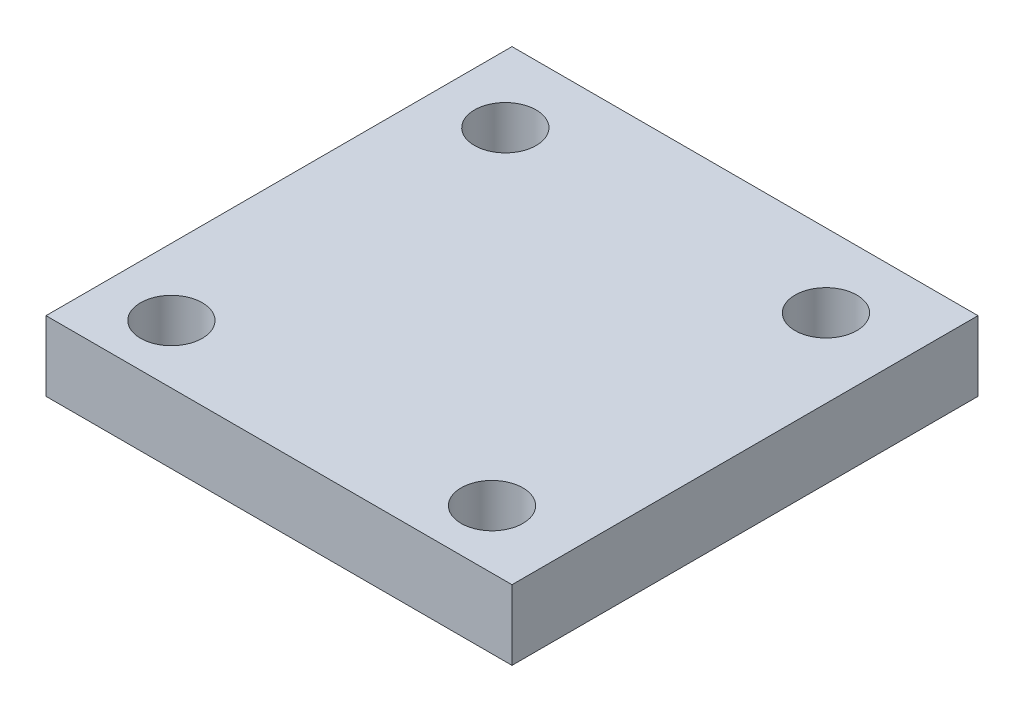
ISO-10303-21;
HEADER;
FILE_DESCRIPTION(('STEP AP214'),'2;1');
FILE_NAME('part.step','',(''),(''),'','','');
FILE_SCHEMA(('AUTOMOTIVE_DESIGN { 1 0 10303 214 1 1 1 1 }'));
ENDSEC;
DATA;
#1=APPLICATION_CONTEXT('core data for automotive mechanical design processes');
#2=APPLICATION_PROTOCOL_DEFINITION('international standard','automotive_design',2000,#1);
#3=PRODUCT_CONTEXT('',#1,'mechanical');
#4=PRODUCT('Part','Part','',(#3));
#5=PRODUCT_RELATED_PRODUCT_CATEGORY('part','',(#4));
#6=PRODUCT_DEFINITION_FORMATION('','',#4);
#7=PRODUCT_DEFINITION_CONTEXT('part definition',#1,'design');
#8=PRODUCT_DEFINITION('design','',#6,#7);
#9=PRODUCT_DEFINITION_SHAPE('','',#8);
#10=(LENGTH_UNIT() NAMED_UNIT(*) SI_UNIT(.MILLI.,.METRE.));
#11=(NAMED_UNIT(*) PLANE_ANGLE_UNIT() SI_UNIT($,.RADIAN.));
#12=(NAMED_UNIT(*) SI_UNIT($,.STERADIAN.) SOLID_ANGLE_UNIT());
#13=UNCERTAINTY_MEASURE_WITH_UNIT(LENGTH_MEASURE(1.E-05),#10,'distance_accuracy_value','');
#14=(GEOMETRIC_REPRESENTATION_CONTEXT(3) GLOBAL_UNCERTAINTY_ASSIGNED_CONTEXT((#13)) GLOBAL_UNIT_ASSIGNED_CONTEXT((#10,
#11,#12)) REPRESENTATION_CONTEXT('',''));
#15=CARTESIAN_POINT('',(0.,0.,0.));
#16=DIRECTION('',(0.,0.,1.));
#17=DIRECTION('',(1.,0.,0.));
#18=AXIS2_PLACEMENT_3D('',#15,#16,#17);
#19=CARTESIAN_POINT('',(-100.,30.,-100.));
#20=DIRECTION('',(1.,0.,0.));
#21=DIRECTION('',(0.,0.,-1.));
#22=AXIS2_PLACEMENT_3D('',#19,#20,#21);
#23=PLANE('',#22);
#24=DIRECTION('',(0.,0.,1.));
#25=VECTOR('',#24,1.);
#26=CARTESIAN_POINT('',(-100.,0.,-100.));
#27=LINE('',#26,#25);
#28=CARTESIAN_POINT('',(-100.,0.,-100.));
#29=VERTEX_POINT('',#28);
#30=CARTESIAN_POINT('',(-100.,0.,100.));
#31=VERTEX_POINT('',#30);
#32=EDGE_CURVE('E80',#29,#31,#27,.T.);
#33=ORIENTED_EDGE('',*,*,#32,.T.);
#34=DIRECTION('',(0.,-1.,0.));
#35=VECTOR('',#34,1.);
#36=CARTESIAN_POINT('',(-100.,30.,100.));
#37=LINE('',#36,#35);
#38=CARTESIAN_POINT('',(-100.,30.,100.));
#39=VERTEX_POINT('',#38);
#40=EDGE_CURVE('E11',#39,#31,#37,.T.);
#41=ORIENTED_EDGE('',*,*,#40,.F.);
#42=DIRECTION('',(0.,0.,1.));
#43=VECTOR('',#42,1.);
#44=CARTESIAN_POINT('',(-100.,30.,-100.));
#45=LINE('',#44,#43);
#46=CARTESIAN_POINT('',(-100.,30.,-100.));
#47=VERTEX_POINT('',#46);
#48=EDGE_CURVE('E103',#47,#39,#45,.T.);
#49=ORIENTED_EDGE('',*,*,#48,.F.);
#50=DIRECTION('',(0.,-1.,0.));
#51=VECTOR('',#50,1.);
#52=CARTESIAN_POINT('',(-100.,30.,-100.));
#53=LINE('',#52,#51);
#54=EDGE_CURVE('E92',#47,#29,#53,.T.);
#55=ORIENTED_EDGE('',*,*,#54,.T.);
#56=EDGE_LOOP('',(#33,#41,#49,#55));
#57=FACE_BOUND('',#56,.T.);
#58=ADVANCED_FACE('F36',(#57),#23,.F.);
#59=CARTESIAN_POINT('',(-100.,30.,100.));
#60=DIRECTION('',(0.,0.,-1.));
#61=DIRECTION('',(-1.,0.,0.));
#62=AXIS2_PLACEMENT_3D('',#59,#60,#61);
#63=PLANE('',#62);
#64=DIRECTION('',(1.,0.,0.));
#65=VECTOR('',#64,1.);
#66=CARTESIAN_POINT('',(-100.,0.,100.));
#67=LINE('',#66,#65);
#68=CARTESIAN_POINT('',(100.,0.,100.));
#69=VERTEX_POINT('',#68);
#70=EDGE_CURVE('E76',#31,#69,#67,.T.);
#71=ORIENTED_EDGE('',*,*,#70,.T.);
#72=DIRECTION('',(0.,-1.,0.));
#73=VECTOR('',#72,1.);
#74=CARTESIAN_POINT('',(100.,30.,100.));
#75=LINE('',#74,#73);
#76=CARTESIAN_POINT('',(100.,30.,100.));
#77=VERTEX_POINT('',#76);
#78=EDGE_CURVE('E43',#77,#69,#75,.T.);
#79=ORIENTED_EDGE('',*,*,#78,.F.);
#80=DIRECTION('',(1.,0.,0.));
#81=VECTOR('',#80,1.);
#82=CARTESIAN_POINT('',(-100.,30.,100.));
#83=LINE('',#82,#81);
#84=EDGE_CURVE('E88',#39,#77,#83,.T.);
#85=ORIENTED_EDGE('',*,*,#84,.F.);
#86=ORIENTED_EDGE('',*,*,#40,.T.);
#87=EDGE_LOOP('',(#71,#79,#85,#86));
#88=FACE_BOUND('',#87,.T.);
#89=ADVANCED_FACE('F87',(#88),#63,.F.);
#90=CARTESIAN_POINT('',(100.,30.,-100.));
#91=DIRECTION('',(-1.,0.,0.));
#92=DIRECTION('',(0.,0.,1.));
#93=AXIS2_PLACEMENT_3D('',#90,#91,#92);
#94=PLANE('',#93);
#95=DIRECTION('',(0.,0.,-1.));
#96=VECTOR('',#95,1.);
#97=CARTESIAN_POINT('',(100.,0.,-100.));
#98=LINE('',#97,#96);
#99=CARTESIAN_POINT('',(100.,0.,-100.));
#100=VERTEX_POINT('',#99);
#101=EDGE_CURVE('E81',#69,#100,#98,.T.);
#102=ORIENTED_EDGE('',*,*,#101,.T.);
#103=DIRECTION('',(0.,-1.,0.));
#104=VECTOR('',#103,1.);
#105=CARTESIAN_POINT('',(100.,30.,-100.));
#106=LINE('',#105,#104);
#107=CARTESIAN_POINT('',(100.,30.,-100.));
#108=VERTEX_POINT('',#107);
#109=EDGE_CURVE('E109',#108,#100,#106,.T.);
#110=ORIENTED_EDGE('',*,*,#109,.F.);
#111=DIRECTION('',(0.,0.,-1.));
#112=VECTOR('',#111,1.);
#113=CARTESIAN_POINT('',(100.,30.,-100.));
#114=LINE('',#113,#112);
#115=EDGE_CURVE('E55',#77,#108,#114,.T.);
#116=ORIENTED_EDGE('',*,*,#115,.F.);
#117=ORIENTED_EDGE('',*,*,#78,.T.);
#118=EDGE_LOOP('',(#102,#110,#116,#117));
#119=FACE_BOUND('',#118,.T.);
#120=ADVANCED_FACE('F112',(#119),#94,.F.);
#121=CARTESIAN_POINT('',(-100.,30.,-100.));
#122=DIRECTION('',(0.,0.,1.));
#123=DIRECTION('',(1.,0.,0.));
#124=AXIS2_PLACEMENT_3D('',#121,#122,#123);
#125=PLANE('',#124);
#126=DIRECTION('',(-1.,0.,0.));
#127=VECTOR('',#126,1.);
#128=CARTESIAN_POINT('',(-100.,0.,-100.));
#129=LINE('',#128,#127);
#130=EDGE_CURVE('E101',#100,#29,#129,.T.);
#131=ORIENTED_EDGE('',*,*,#130,.T.);
#132=ORIENTED_EDGE('',*,*,#54,.F.);
#133=DIRECTION('',(-1.,0.,0.));
#134=VECTOR('',#133,1.);
#135=CARTESIAN_POINT('',(-100.,30.,-100.));
#136=LINE('',#135,#134);
#137=EDGE_CURVE('E50',#108,#47,#136,.T.);
#138=ORIENTED_EDGE('',*,*,#137,.F.);
#139=ORIENTED_EDGE('',*,*,#109,.T.);
#140=EDGE_LOOP('',(#131,#132,#138,#139));
#141=FACE_BOUND('',#140,.T.);
#142=ADVANCED_FACE('F114',(#141),#125,.F.);
#143=CARTESIAN_POINT('',(-100.,30.,100.));
#144=DIRECTION('',(0.,1.,0.));
#145=DIRECTION('',(0.,0.,1.));
#146=AXIS2_PLACEMENT_3D('',#143,#144,#145);
#147=PLANE('',#146);
#148=CARTESIAN_POINT('',(-71.2788259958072,30.,74.899942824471));
#149=DIRECTION('',(0.,1.,0.));
#150=DIRECTION('',(0.,0.,1.));
#151=AXIS2_PLACEMENT_3D('',#148,#149,#150);
#152=CIRCLE('',#151,13.25);
#153=CARTESIAN_POINT('',(-71.2788259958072,30.,88.149942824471));
#154=VERTEX_POINT('',#153);
#155=EDGE_CURVE('E209',#154,#154,#152,.T.);
#156=ORIENTED_EDGE('',*,*,#155,.F.);
#157=EDGE_LOOP('',(#156));
#158=FACE_BOUND('',#157,.T.);
#159=CARTESIAN_POINT('',(66.3236134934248,30.,74.899942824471));
#160=DIRECTION('',(0.,1.,0.));
#161=DIRECTION('',(0.,0.,1.));
#162=AXIS2_PLACEMENT_3D('',#159,#160,#161);
#163=CIRCLE('',#162,13.25);
#164=CARTESIAN_POINT('',(66.3236134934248,30.,88.149942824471));
#165=VERTEX_POINT('',#164);
#166=EDGE_CURVE('E213',#165,#165,#163,.T.);
#167=ORIENTED_EDGE('',*,*,#166,.F.);
#168=EDGE_LOOP('',(#167));
#169=FACE_BOUND('',#168,.T.);
#170=CARTESIAN_POINT('',(66.3236134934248,30.,-68.4200495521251));
#171=DIRECTION('',(0.,1.,0.));
#172=DIRECTION('',(0.,0.,1.));
#173=AXIS2_PLACEMENT_3D('',#170,#171,#172);
#174=CIRCLE('',#173,13.25);
#175=CARTESIAN_POINT('',(66.3236134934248,30.,-55.1700495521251));
#176=VERTEX_POINT('',#175);
#177=EDGE_CURVE('E222',#176,#176,#174,.T.);
#178=ORIENTED_EDGE('',*,*,#177,.F.);
#179=EDGE_LOOP('',(#178));
#180=FACE_BOUND('',#179,.T.);
#181=CARTESIAN_POINT('',(-71.2788259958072,30.,-68.4200495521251));
#182=DIRECTION('',(0.,1.,0.));
#183=DIRECTION('',(0.,0.,1.));
#184=AXIS2_PLACEMENT_3D('',#181,#182,#183);
#185=CIRCLE('',#184,13.25);
#186=CARTESIAN_POINT('',(-71.2788259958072,30.,-55.1700495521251));
#187=VERTEX_POINT('',#186);
#188=EDGE_CURVE('E93',#187,#187,#185,.T.);
#189=ORIENTED_EDGE('',*,*,#188,.F.);
#190=EDGE_LOOP('',(#189));
#191=FACE_BOUND('',#190,.T.);
#192=ORIENTED_EDGE('',*,*,#48,.T.);
#193=ORIENTED_EDGE('',*,*,#84,.T.);
#194=ORIENTED_EDGE('',*,*,#115,.T.);
#195=ORIENTED_EDGE('',*,*,#137,.T.);
#196=EDGE_LOOP('',(#192,#193,#194,#195));
#197=FACE_BOUND('',#196,.T.);
#198=ADVANCED_FACE('F115',(#158,#169,#180,#191,#197),#147,.T.);
#199=CARTESIAN_POINT('',(-100.,0.,100.));
#200=DIRECTION('',(0.,1.,0.));
#201=DIRECTION('',(0.,0.,1.));
#202=AXIS2_PLACEMENT_3D('',#199,#200,#201);
#203=PLANE('',#202);
#204=CARTESIAN_POINT('',(-71.2788259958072,0.,74.899942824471));
#205=DIRECTION('',(0.,1.,0.));
#206=DIRECTION('',(0.,0.,1.));
#207=AXIS2_PLACEMENT_3D('',#204,#205,#206);
#208=CIRCLE('',#207,13.25);
#209=CARTESIAN_POINT('',(-71.2788259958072,0.,88.149942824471));
#210=VERTEX_POINT('',#209);
#211=EDGE_CURVE('E207',#210,#210,#208,.T.);
#212=ORIENTED_EDGE('',*,*,#211,.T.);
#213=EDGE_LOOP('',(#212));
#214=FACE_BOUND('',#213,.T.);
#215=CARTESIAN_POINT('',(66.3236134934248,0.,74.899942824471));
#216=DIRECTION('',(0.,1.,0.));
#217=DIRECTION('',(0.,0.,1.));
#218=AXIS2_PLACEMENT_3D('',#215,#216,#217);
#219=CIRCLE('',#218,13.25);
#220=CARTESIAN_POINT('',(66.3236134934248,0.,88.149942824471));
#221=VERTEX_POINT('',#220);
#222=EDGE_CURVE('E210',#221,#221,#219,.T.);
#223=ORIENTED_EDGE('',*,*,#222,.T.);
#224=EDGE_LOOP('',(#223));
#225=FACE_BOUND('',#224,.T.);
#226=CARTESIAN_POINT('',(66.3236134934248,0.,-68.4200495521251));
#227=DIRECTION('',(0.,1.,0.));
#228=DIRECTION('',(0.,0.,1.));
#229=AXIS2_PLACEMENT_3D('',#226,#227,#228);
#230=CIRCLE('',#229,13.25);
#231=CARTESIAN_POINT('',(66.3236134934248,0.,-55.1700495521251));
#232=VERTEX_POINT('',#231);
#233=EDGE_CURVE('E219',#232,#232,#230,.T.);
#234=ORIENTED_EDGE('',*,*,#233,.T.);
#235=EDGE_LOOP('',(#234));
#236=FACE_BOUND('',#235,.T.);
#237=CARTESIAN_POINT('',(-71.2788259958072,0.,-68.4200495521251));
#238=DIRECTION('',(0.,1.,0.));
#239=DIRECTION('',(0.,0.,1.));
#240=AXIS2_PLACEMENT_3D('',#237,#238,#239);
#241=CIRCLE('',#240,13.25);
#242=CARTESIAN_POINT('',(-71.2788259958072,0.,-55.1700495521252));
#243=VERTEX_POINT('',#242);
#244=EDGE_CURVE('E96',#243,#243,#241,.T.);
#245=ORIENTED_EDGE('',*,*,#244,.T.);
#246=EDGE_LOOP('',(#245));
#247=FACE_BOUND('',#246,.T.);
#248=ORIENTED_EDGE('',*,*,#32,.F.);
#249=ORIENTED_EDGE('',*,*,#130,.F.);
#250=ORIENTED_EDGE('',*,*,#101,.F.);
#251=ORIENTED_EDGE('',*,*,#70,.F.);
#252=EDGE_LOOP('',(#248,#249,#250,#251));
#253=FACE_BOUND('',#252,.T.);
#254=ADVANCED_FACE('F77',(#214,#225,#236,#247,#253),#203,.F.);
#255=CARTESIAN_POINT('',(-71.2788259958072,30.,-68.4200495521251));
#256=DIRECTION('',(0.,1.,0.));
#257=DIRECTION('',(0.,0.,1.));
#258=AXIS2_PLACEMENT_3D('',#255,#256,#257);
#259=CYLINDRICAL_SURFACE('',#258,13.25);
#260=ORIENTED_EDGE('',*,*,#244,.F.);
#261=EDGE_LOOP('',(#260));
#262=FACE_BOUND('',#261,.T.);
#263=ORIENTED_EDGE('',*,*,#188,.T.);
#264=EDGE_LOOP('',(#263));
#265=FACE_BOUND('',#264,.T.);
#266=ADVANCED_FACE('F123',(#262,#265),#259,.F.);
#267=CARTESIAN_POINT('',(66.3236134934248,30.,-68.4200495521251));
#268=DIRECTION('',(0.,1.,0.));
#269=DIRECTION('',(0.,0.,1.));
#270=AXIS2_PLACEMENT_3D('',#267,#268,#269);
#271=CYLINDRICAL_SURFACE('',#270,13.25);
#272=ORIENTED_EDGE('',*,*,#233,.F.);
#273=EDGE_LOOP('',(#272));
#274=FACE_BOUND('',#273,.T.);
#275=ORIENTED_EDGE('',*,*,#177,.T.);
#276=EDGE_LOOP('',(#275));
#277=FACE_BOUND('',#276,.T.);
#278=ADVANCED_FACE('F163',(#274,#277),#271,.F.);
#279=CARTESIAN_POINT('',(66.3236134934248,30.,74.899942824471));
#280=DIRECTION('',(0.,1.,0.));
#281=DIRECTION('',(0.,0.,1.));
#282=AXIS2_PLACEMENT_3D('',#279,#280,#281);
#283=CYLINDRICAL_SURFACE('',#282,13.25);
#284=ORIENTED_EDGE('',*,*,#222,.F.);
#285=EDGE_LOOP('',(#284));
#286=FACE_BOUND('',#285,.T.);
#287=ORIENTED_EDGE('',*,*,#166,.T.);
#288=EDGE_LOOP('',(#287));
#289=FACE_BOUND('',#288,.T.);
#290=ADVANCED_FACE('F174',(#286,#289),#283,.F.);
#291=CARTESIAN_POINT('',(-71.2788259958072,30.,74.899942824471));
#292=DIRECTION('',(0.,1.,0.));
#293=DIRECTION('',(0.,0.,1.));
#294=AXIS2_PLACEMENT_3D('',#291,#292,#293);
#295=CYLINDRICAL_SURFACE('',#294,13.25);
#296=ORIENTED_EDGE('',*,*,#211,.F.);
#297=EDGE_LOOP('',(#296));
#298=FACE_BOUND('',#297,.T.);
#299=ORIENTED_EDGE('',*,*,#155,.T.);
#300=EDGE_LOOP('',(#299));
#301=FACE_BOUND('',#300,.T.);
#302=ADVANCED_FACE('F185',(#298,#301),#295,.F.);
#303=CLOSED_SHELL('',(#58,#89,#120,#142,#198,#254,#266,#278,#290,#302));
#304=MANIFOLD_SOLID_BREP('B2',#303);
#305=ADVANCED_BREP_SHAPE_REPRESENTATION('',(#18,#304),#14);
#306=SHAPE_DEFINITION_REPRESENTATION(#9,#305);
ENDSEC;
END-ISO-10303-21;
